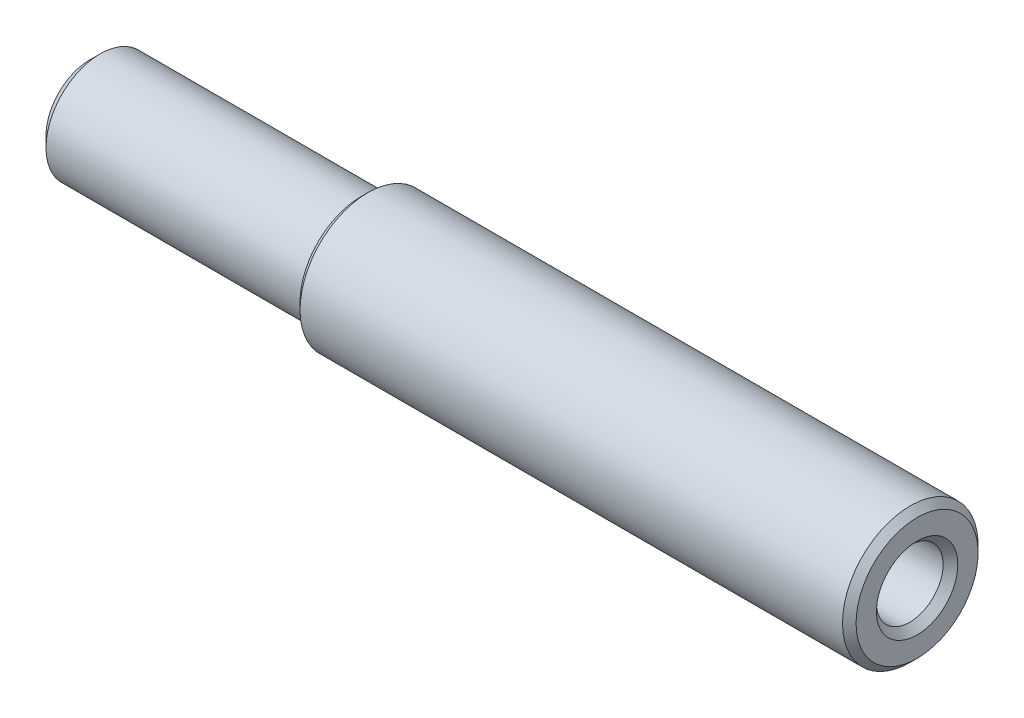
ISO-10303-21;
HEADER;
FILE_DESCRIPTION(('STEP AP214'),'2;1');
FILE_NAME('part.step','',(''),(''),'','','');
FILE_SCHEMA(('AUTOMOTIVE_DESIGN { 1 0 10303 214 1 1 1 1 }'));
ENDSEC;
DATA;
#1=APPLICATION_CONTEXT('core data for automotive mechanical design processes');
#2=APPLICATION_PROTOCOL_DEFINITION('international standard','automotive_design',2000,#1);
#3=PRODUCT_CONTEXT('',#1,'mechanical');
#4=PRODUCT('Part','Part','',(#3));
#5=PRODUCT_RELATED_PRODUCT_CATEGORY('part','',(#4));
#6=PRODUCT_DEFINITION_FORMATION('','',#4);
#7=PRODUCT_DEFINITION_CONTEXT('part definition',#1,'design');
#8=PRODUCT_DEFINITION('design','',#6,#7);
#9=PRODUCT_DEFINITION_SHAPE('','',#8);
#10=(LENGTH_UNIT() NAMED_UNIT(*) SI_UNIT(.MILLI.,.METRE.));
#11=(NAMED_UNIT(*) PLANE_ANGLE_UNIT() SI_UNIT($,.RADIAN.));
#12=(NAMED_UNIT(*) SI_UNIT($,.STERADIAN.) SOLID_ANGLE_UNIT());
#13=UNCERTAINTY_MEASURE_WITH_UNIT(LENGTH_MEASURE(1.E-05),#10,'distance_accuracy_value','');
#14=(GEOMETRIC_REPRESENTATION_CONTEXT(3) GLOBAL_UNCERTAINTY_ASSIGNED_CONTEXT((#13)) GLOBAL_UNIT_ASSIGNED_CONTEXT((#10,
#11,#12)) REPRESENTATION_CONTEXT('',''));
#15=CARTESIAN_POINT('',(0.,0.,0.));
#16=DIRECTION('',(0.,0.,1.));
#17=DIRECTION('',(1.,0.,0.));
#18=AXIS2_PLACEMENT_3D('',#15,#16,#17);
#19=CARTESIAN_POINT('',(-20.,0.,0.));
#20=DIRECTION('',(1.,0.,0.));
#21=DIRECTION('',(0.,0.,-1.));
#22=AXIS2_PLACEMENT_3D('',#19,#20,#21);
#23=PLANE('',#22);
#24=CARTESIAN_POINT('',(-19.9999999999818,0.,0.));
#25=DIRECTION('',(1.,0.,0.));
#26=DIRECTION('',(0.,0.,-1.));
#27=AXIS2_PLACEMENT_3D('',#24,#25,#26);
#28=CIRCLE('',#27,3.23300000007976);
#29=CARTESIAN_POINT('',(-19.9999999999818,0.,-3.23300000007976));
#30=VERTEX_POINT('',#29);
#31=EDGE_CURVE('E19',#30,#30,#28,.T.);
#32=ORIENTED_EDGE('',*,*,#31,.F.);
#33=EDGE_LOOP('',(#32));
#34=FACE_BOUND('',#33,.T.);
#35=ADVANCED_FACE('F16',(#34),#23,.F.);
#36=CARTESIAN_POINT('',(23.4194156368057,0.,0.));
#37=DIRECTION('',(1.,0.,0.));
#38=DIRECTION('',(0.,0.,-1.));
#39=AXIS2_PLACEMENT_3D('',#36,#37,#38);
#40=CONICAL_SURFACE('',#39,2.45849999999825,1.04719755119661);
#41=CARTESIAN_POINT('',(22.0000000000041,0.,0.));
#42=VERTEX_POINT('',#41);
#43=VERTEX_LOOP('',#42);
#44=FACE_BOUND('',#43,.T.);
#45=CARTESIAN_POINT('',(23.4194156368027,0.,0.));
#46=DIRECTION('',(-1.,0.,0.));
#47=DIRECTION('',(0.,0.,1.));
#48=AXIS2_PLACEMENT_3D('',#45,#46,#47);
#49=CIRCLE('',#48,2.4585);
#50=CARTESIAN_POINT('',(23.4194156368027,0.,2.4585));
#51=VERTEX_POINT('',#50);
#52=EDGE_CURVE('E33',#51,#51,#49,.F.);
#53=ORIENTED_EDGE('',*,*,#52,.T.);
#54=EDGE_LOOP('',(#53));
#55=FACE_BOUND('',#54,.T.);
#56=ADVANCED_FACE('F27',(#44,#55),#40,.F.);
#57=CARTESIAN_POINT('',(-19.2330000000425,0.,0.));
#58=DIRECTION('',(1.,0.,0.));
#59=DIRECTION('',(0.,0.,-1.));
#60=AXIS2_PLACEMENT_3D('',#57,#58,#59);
#61=CONICAL_SURFACE('',#60,4.0000000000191,0.785398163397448);
#62=ORIENTED_EDGE('',*,*,#31,.T.);
#63=EDGE_LOOP('',(#62));
#64=FACE_BOUND('',#63,.T.);
#65=CARTESIAN_POINT('',(-19.233,0.,0.));
#66=DIRECTION('',(-1.,0.,0.));
#67=DIRECTION('',(0.,0.,1.));
#68=AXIS2_PLACEMENT_3D('',#65,#66,#67);
#69=CIRCLE('',#68,4.);
#70=CARTESIAN_POINT('',(-19.233,0.,4.));
#71=VERTEX_POINT('',#70);
#72=EDGE_CURVE('E35',#71,#71,#69,.F.);
#73=ORIENTED_EDGE('',*,*,#72,.F.);
#74=EDGE_LOOP('',(#73));
#75=FACE_BOUND('',#74,.T.);
#76=ADVANCED_FACE('F30',(#64,#75),#61,.T.);
#77=CARTESIAN_POINT('',(41.,0.,0.));
#78=DIRECTION('',(-1.,0.,0.));
#79=DIRECTION('',(0.,0.,1.));
#80=AXIS2_PLACEMENT_3D('',#77,#78,#79);
#81=CYLINDRICAL_SURFACE('',#80,2.4585);
#82=ORIENTED_EDGE('',*,*,#52,.F.);
#83=EDGE_LOOP('',(#82));
#84=FACE_BOUND('',#83,.T.);
#85=CARTESIAN_POINT('',(40.4584999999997,0.,0.));
#86=DIRECTION('',(1.,0.,0.));
#87=DIRECTION('',(0.,0.,-1.));
#88=AXIS2_PLACEMENT_3D('',#85,#86,#87);
#89=CIRCLE('',#88,2.45849999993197);
#90=CARTESIAN_POINT('',(40.4584999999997,0.,-2.45849999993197));
#91=VERTEX_POINT('',#90);
#92=EDGE_CURVE('E38',#91,#91,#89,.T.);
#93=ORIENTED_EDGE('',*,*,#92,.T.);
#94=EDGE_LOOP('',(#93));
#95=FACE_BOUND('',#94,.T.);
#96=ADVANCED_FACE('F97',(#84,#95),#81,.F.);
#97=CARTESIAN_POINT('',(41.,0.,0.));
#98=DIRECTION('',(-1.,0.,0.));
#99=DIRECTION('',(0.,0.,1.));
#100=AXIS2_PLACEMENT_3D('',#97,#98,#99);
#101=CYLINDRICAL_SURFACE('',#100,4.);
#102=ORIENTED_EDGE('',*,*,#72,.T.);
#103=EDGE_LOOP('',(#102));
#104=FACE_BOUND('',#103,.T.);
#105=CARTESIAN_POINT('',(-0.300000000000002,0.,0.));
#106=DIRECTION('',(1.,0.,0.));
#107=DIRECTION('',(0.,0.,-1.));
#108=AXIS2_PLACEMENT_3D('',#105,#106,#107);
#109=CIRCLE('',#108,4.);
#110=CARTESIAN_POINT('',(-0.300000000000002,0.,-4.));
#111=VERTEX_POINT('',#110);
#112=EDGE_CURVE('E54',#111,#111,#109,.F.);
#113=ORIENTED_EDGE('',*,*,#112,.T.);
#114=EDGE_LOOP('',(#113));
#115=FACE_BOUND('',#114,.T.);
#116=ADVANCED_FACE('F93',(#104,#115),#101,.T.);
#117=CARTESIAN_POINT('',(40.9999999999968,0.,0.));
#118=DIRECTION('',(1.,0.,0.));
#119=DIRECTION('',(0.,0.,-1.));
#120=AXIS2_PLACEMENT_3D('',#117,#118,#119);
#121=CONICAL_SURFACE('',#120,2.99999999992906,0.785398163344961);
#122=ORIENTED_EDGE('',*,*,#92,.F.);
#123=EDGE_LOOP('',(#122));
#124=FACE_BOUND('',#123,.T.);
#125=CARTESIAN_POINT('',(41.0000000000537,0.,0.));
#126=DIRECTION('',(1.,0.,0.));
#127=DIRECTION('',(0.,0.,-1.));
#128=AXIS2_PLACEMENT_3D('',#125,#126,#127);
#129=CIRCLE('',#128,2.9999999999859);
#130=CARTESIAN_POINT('',(41.0000000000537,0.,-2.9999999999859));
#131=VERTEX_POINT('',#130);
#132=EDGE_CURVE('E52',#131,#131,#129,.T.);
#133=ORIENTED_EDGE('',*,*,#132,.T.);
#134=EDGE_LOOP('',(#133));
#135=FACE_BOUND('',#134,.T.);
#136=ADVANCED_FACE('F88',(#124,#135),#121,.F.);
#137=CARTESIAN_POINT('',(-0.300000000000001,0.,0.));
#138=DIRECTION('',(1.,0.,0.));
#139=DIRECTION('',(0.,0.,-1.));
#140=AXIS2_PLACEMENT_3D('',#137,#138,#139);
#141=TOROIDAL_SURFACE('',#140,4.3,0.300000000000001);
#142=ORIENTED_EDGE('',*,*,#112,.F.);
#143=EDGE_LOOP('',(#142));
#144=FACE_BOUND('',#143,.T.);
#145=CARTESIAN_POINT('',(0.,0.,0.));
#146=DIRECTION('',(-1.,0.,0.));
#147=DIRECTION('',(0.,0.,-1.));
#148=AXIS2_PLACEMENT_3D('',#145,#146,#147);
#149=CIRCLE('',#148,4.3);
#150=CARTESIAN_POINT('',(0.,0.,-4.3));
#151=VERTEX_POINT('',#150);
#152=EDGE_CURVE('E51',#151,#151,#149,.T.);
#153=ORIENTED_EDGE('',*,*,#152,.T.);
#154=EDGE_LOOP('',(#153));
#155=FACE_BOUND('',#154,.T.);
#156=ADVANCED_FACE('F77',(#144,#155),#141,.F.);
#157=CARTESIAN_POINT('',(41.,4.5,0.));
#158=DIRECTION('',(-1.,0.,0.));
#159=DIRECTION('',(0.,0.,1.));
#160=AXIS2_PLACEMENT_3D('',#157,#158,#159);
#161=PLANE('',#160);
#162=CARTESIAN_POINT('',(40.9999999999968,0.,0.));
#163=DIRECTION('',(-1.,0.,0.));
#164=DIRECTION('',(0.,0.,1.));
#165=AXIS2_PLACEMENT_3D('',#162,#163,#164);
#166=CIRCLE('',#165,4.49999999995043);
#167=CARTESIAN_POINT('',(40.9999999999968,0.,4.49999999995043));
#168=VERTEX_POINT('',#167);
#169=EDGE_CURVE('E49',#168,#168,#166,.T.);
#170=ORIENTED_EDGE('',*,*,#169,.F.);
#171=EDGE_LOOP('',(#170));
#172=FACE_BOUND('',#171,.T.);
#173=ORIENTED_EDGE('',*,*,#132,.F.);
#174=EDGE_LOOP('',(#173));
#175=FACE_BOUND('',#174,.T.);
#176=ADVANCED_FACE('F87',(#172,#175),#161,.F.);
#177=CARTESIAN_POINT('',(0.,4.3,0.));
#178=DIRECTION('',(1.,0.,0.));
#179=DIRECTION('',(0.,0.,-1.));
#180=AXIS2_PLACEMENT_3D('',#177,#178,#179);
#181=PLANE('',#180);
#182=ORIENTED_EDGE('',*,*,#152,.F.);
#183=EDGE_LOOP('',(#182));
#184=FACE_BOUND('',#183,.T.);
#185=CARTESIAN_POINT('',(0.,0.,0.));
#186=DIRECTION('',(1.,0.,0.));
#187=DIRECTION('',(0.,0.,-1.));
#188=AXIS2_PLACEMENT_3D('',#185,#186,#187);
#189=CIRCLE('',#188,4.49999999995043);
#190=CARTESIAN_POINT('',(0.,0.,-4.49999999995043));
#191=VERTEX_POINT('',#190);
#192=EDGE_CURVE('E46',#191,#191,#189,.T.);
#193=ORIENTED_EDGE('',*,*,#192,.F.);
#194=EDGE_LOOP('',(#193));
#195=FACE_BOUND('',#194,.T.);
#196=ADVANCED_FACE('F121',(#184,#195),#181,.F.);
#197=CARTESIAN_POINT('',(40.5000000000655,0.,0.));
#198=DIRECTION('',(-1.,0.,0.));
#199=DIRECTION('',(0.,0.,1.));
#200=AXIS2_PLACEMENT_3D('',#197,#198,#199);
#201=CONICAL_SURFACE('',#200,4.99999999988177,0.785398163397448);
#202=CARTESIAN_POINT('',(40.5,0.,0.));
#203=DIRECTION('',(-1.,0.,0.));
#204=DIRECTION('',(0.,0.,1.));
#205=AXIS2_PLACEMENT_3D('',#202,#203,#204);
#206=CIRCLE('',#205,5.);
#207=CARTESIAN_POINT('',(40.5,0.,5.));
#208=VERTEX_POINT('',#207);
#209=EDGE_CURVE('E23',#208,#208,#206,.T.);
#210=ORIENTED_EDGE('',*,*,#209,.F.);
#211=EDGE_LOOP('',(#210));
#212=FACE_BOUND('',#211,.T.);
#213=ORIENTED_EDGE('',*,*,#169,.T.);
#214=EDGE_LOOP('',(#213));
#215=FACE_BOUND('',#214,.T.);
#216=ADVANCED_FACE('F115',(#212,#215),#201,.T.);
#217=CARTESIAN_POINT('',(0.499999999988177,0.,0.));
#218=DIRECTION('',(1.,0.,0.));
#219=DIRECTION('',(0.,0.,-1.));
#220=AXIS2_PLACEMENT_3D('',#217,#218,#219);
#221=CONICAL_SURFACE('',#220,4.99999999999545,0.785398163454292);
#222=ORIENTED_EDGE('',*,*,#192,.T.);
#223=EDGE_LOOP('',(#222));
#224=FACE_BOUND('',#223,.T.);
#225=CARTESIAN_POINT('',(0.5,0.,0.));
#226=DIRECTION('',(-1.,0.,0.));
#227=DIRECTION('',(0.,0.,1.));
#228=AXIS2_PLACEMENT_3D('',#225,#226,#227);
#229=CIRCLE('',#228,5.);
#230=CARTESIAN_POINT('',(0.5,0.,5.));
#231=VERTEX_POINT('',#230);
#232=EDGE_CURVE('E11',#231,#231,#229,.F.);
#233=ORIENTED_EDGE('',*,*,#232,.F.);
#234=EDGE_LOOP('',(#233));
#235=FACE_BOUND('',#234,.T.);
#236=ADVANCED_FACE('F109',(#224,#235),#221,.T.);
#237=CARTESIAN_POINT('',(41.,0.,0.));
#238=DIRECTION('',(-1.,0.,0.));
#239=DIRECTION('',(0.,0.,1.));
#240=AXIS2_PLACEMENT_3D('',#237,#238,#239);
#241=CYLINDRICAL_SURFACE('',#240,5.);
#242=ORIENTED_EDGE('',*,*,#232,.T.);
#243=EDGE_LOOP('',(#242));
#244=FACE_BOUND('',#243,.T.);
#245=ORIENTED_EDGE('',*,*,#209,.T.);
#246=EDGE_LOOP('',(#245));
#247=FACE_BOUND('',#246,.T.);
#248=ADVANCED_FACE('F107',(#244,#247),#241,.T.);
#249=CLOSED_SHELL('',(#35,#56,#76,#96,#116,#136,#156,#176,#196,#216,#236,#248));
#250=MANIFOLD_SOLID_BREP('B1',#249);
#251=ADVANCED_BREP_SHAPE_REPRESENTATION('',(#18,#250),#14);
#252=SHAPE_DEFINITION_REPRESENTATION(#9,#251);
ENDSEC;
END-ISO-10303-21;
